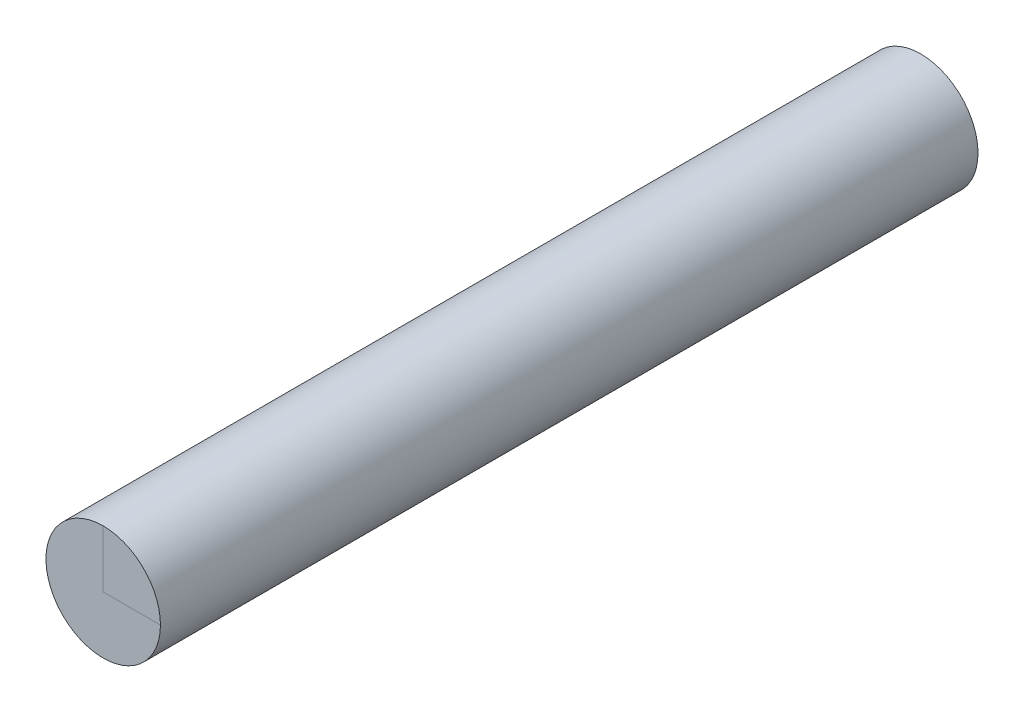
from build123d import *

# Parameters (mm, degrees)
SKETCH1_W = 14.986
SKETCH1_H = 214.00934559


with BuildPart() as part:
    # Sketch1 → Revolve1 (revolve)
    with BuildSketch(Plane(origin=(0, 0, 531.9895366), x_dir=(1, 0, 0), z_dir=(0, 1, 0))):
        with Locations((7.493, 638.994209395)):
            Rectangle(SKETCH1_W, SKETCH1_H)
    revolve(axis=Axis((0, 0, -135.040831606), (0, 0, 1)))


solid = part.part
